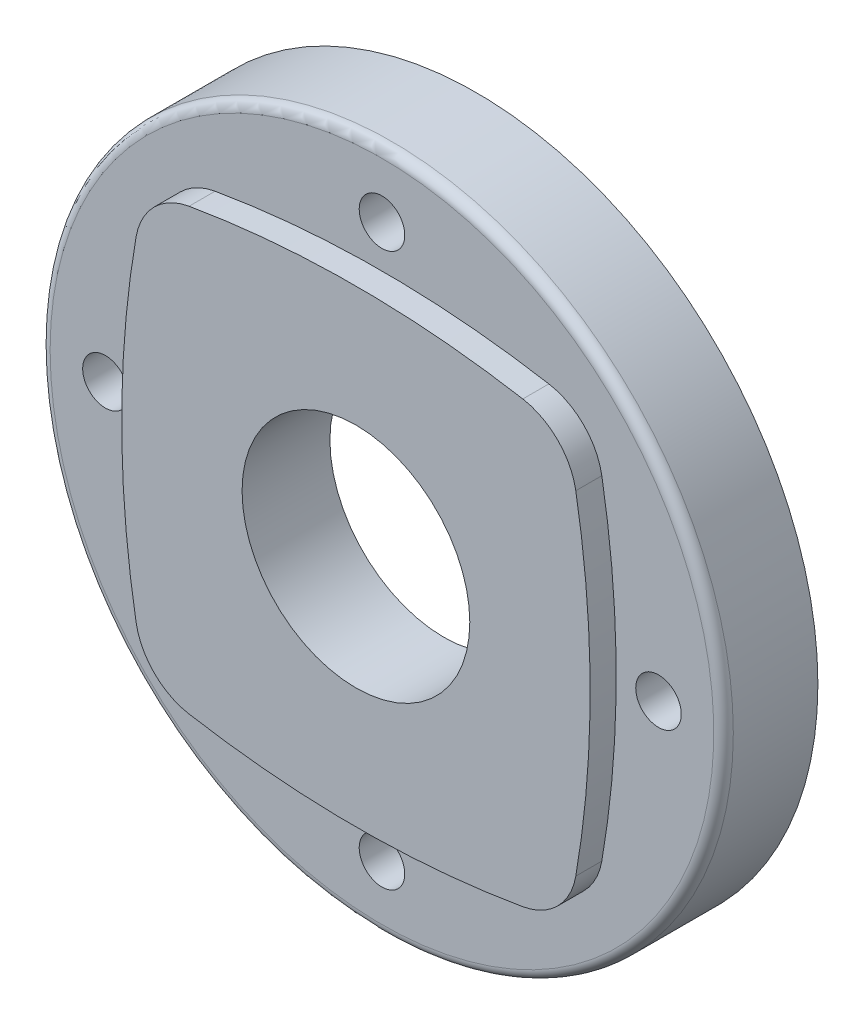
ISO-10303-21;
HEADER;
FILE_DESCRIPTION(('STEP AP214'),'2;1');
FILE_NAME('part.step','',(''),(''),'','','');
FILE_SCHEMA(('AUTOMOTIVE_DESIGN { 1 0 10303 214 1 1 1 1 }'));
ENDSEC;
DATA;
#1=APPLICATION_CONTEXT('core data for automotive mechanical design processes');
#2=APPLICATION_PROTOCOL_DEFINITION('international standard','automotive_design',2000,#1);
#3=PRODUCT_CONTEXT('',#1,'mechanical');
#4=PRODUCT('Part','Part','',(#3));
#5=PRODUCT_RELATED_PRODUCT_CATEGORY('part','',(#4));
#6=PRODUCT_DEFINITION_FORMATION('','',#4);
#7=PRODUCT_DEFINITION_CONTEXT('part definition',#1,'design');
#8=PRODUCT_DEFINITION('design','',#6,#7);
#9=PRODUCT_DEFINITION_SHAPE('','',#8);
#10=(LENGTH_UNIT() NAMED_UNIT(*) SI_UNIT(.MILLI.,.METRE.));
#11=(NAMED_UNIT(*) PLANE_ANGLE_UNIT() SI_UNIT($,.RADIAN.));
#12=(NAMED_UNIT(*) SI_UNIT($,.STERADIAN.) SOLID_ANGLE_UNIT());
#13=UNCERTAINTY_MEASURE_WITH_UNIT(LENGTH_MEASURE(1.E-05),#10,'distance_accuracy_value','');
#14=(GEOMETRIC_REPRESENTATION_CONTEXT(3) GLOBAL_UNCERTAINTY_ASSIGNED_CONTEXT((#13)) GLOBAL_UNIT_ASSIGNED_CONTEXT((#10,
#11,#12)) REPRESENTATION_CONTEXT('',''));
#15=CARTESIAN_POINT('',(0.,0.,0.));
#16=DIRECTION('',(0.,0.,1.));
#17=DIRECTION('',(1.,0.,0.));
#18=AXIS2_PLACEMENT_3D('',#15,#16,#17);
#19=CARTESIAN_POINT('',(-36.432,36.432,19.));
#20=DIRECTION('',(0.,0.,-1.));
#21=DIRECTION('',(-1.,0.,0.));
#22=AXIS2_PLACEMENT_3D('',#19,#20,#21);
#23=PLANE('',#22);
#24=CARTESIAN_POINT('',(114.,0.,19.));
#25=DIRECTION('',(0.,0.,1.));
#26=DIRECTION('',(1.,0.,0.));
#27=AXIS2_PLACEMENT_3D('',#24,#25,#26);
#28=CIRCLE('',#27,150.);
#29=CARTESIAN_POINT('',(-33.7909800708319,-25.6481229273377,19.));
#30=VERTEX_POINT('',#29);
#31=CARTESIAN_POINT('',(-33.7909800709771,25.64812292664,19.));
#32=VERTEX_POINT('',#31);
#33=EDGE_CURVE('E97',#30,#32,#28,.F.);
#34=ORIENTED_EDGE('',*,*,#33,.F.);
#35=CARTESIAN_POINT('',(-23.938248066,-23.938248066,19.));
#36=DIRECTION('',(0.,0.,1.));
#37=DIRECTION('',(1.,0.,0.));
#38=AXIS2_PLACEMENT_3D('',#35,#36,#37);
#39=CIRCLE('',#38,10.);
#40=CARTESIAN_POINT('',(-25.6481229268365,-33.7909800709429,19.));
#41=VERTEX_POINT('',#40);
#42=EDGE_CURVE('E91',#41,#30,#39,.F.);
#43=ORIENTED_EDGE('',*,*,#42,.F.);
#44=CARTESIAN_POINT('',(0.,114.,19.));
#45=DIRECTION('',(0.,0.,1.));
#46=DIRECTION('',(1.,0.,0.));
#47=AXIS2_PLACEMENT_3D('',#44,#45,#46);
#48=CIRCLE('',#47,150.);
#49=CARTESIAN_POINT('',(25.6481229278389,-33.7909800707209,19.));
#50=VERTEX_POINT('',#49);
#51=EDGE_CURVE('E80',#50,#41,#48,.F.);
#52=ORIENTED_EDGE('',*,*,#51,.F.);
#53=CARTESIAN_POINT('',(23.938248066,-23.938248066,19.));
#54=DIRECTION('',(0.,0.,1.));
#55=DIRECTION('',(1.,0.,0.));
#56=AXIS2_PLACEMENT_3D('',#53,#54,#55);
#57=CIRCLE('',#56,10.);
#58=CARTESIAN_POINT('',(33.7909800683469,-25.6481229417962,19.));
#59=VERTEX_POINT('',#58);
#60=EDGE_CURVE('E106',#59,#50,#57,.F.);
#61=ORIENTED_EDGE('',*,*,#60,.F.);
#62=CARTESIAN_POINT('',(-114.,0.,18.9999999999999));
#63=DIRECTION('',(0.,0.,1.));
#64=DIRECTION('',(1.,0.,0.));
#65=AXIS2_PLACEMENT_3D('',#62,#63,#64);
#66=CIRCLE('',#65,150.);
#67=CARTESIAN_POINT('',(33.7909800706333,25.6481229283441,19.));
#68=VERTEX_POINT('',#67);
#69=EDGE_CURVE('E203',#68,#59,#66,.F.);
#70=ORIENTED_EDGE('',*,*,#69,.F.);
#71=CARTESIAN_POINT('',(23.938248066,23.938248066,19.));
#72=DIRECTION('',(0.,0.,1.));
#73=DIRECTION('',(1.,0.,0.));
#74=AXIS2_PLACEMENT_3D('',#71,#72,#73);
#75=CIRCLE('',#74,10.);
#76=CARTESIAN_POINT('',(25.6481229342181,33.790980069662,19.));
#77=VERTEX_POINT('',#76);
#78=EDGE_CURVE('E200',#77,#68,#75,.F.);
#79=ORIENTED_EDGE('',*,*,#78,.F.);
#80=CARTESIAN_POINT('',(0.,-114.,19.));
#81=DIRECTION('',(0.,0.,1.));
#82=DIRECTION('',(1.,0.,0.));
#83=AXIS2_PLACEMENT_3D('',#80,#81,#82);
#84=CIRCLE('',#83,150.);
#85=CARTESIAN_POINT('',(-25.6481229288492,33.7909800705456,19.));
#86=VERTEX_POINT('',#85);
#87=EDGE_CURVE('E196',#86,#77,#84,.F.);
#88=ORIENTED_EDGE('',*,*,#87,.F.);
#89=CARTESIAN_POINT('',(-23.938248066,23.938248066,19.));
#90=DIRECTION('',(0.,0.,1.));
#91=DIRECTION('',(1.,0.,0.));
#92=AXIS2_PLACEMENT_3D('',#89,#90,#91);
#93=CIRCLE('',#92,10.);
#94=EDGE_CURVE('E191',#32,#86,#93,.F.);
#95=ORIENTED_EDGE('',*,*,#94,.F.);
#96=EDGE_LOOP('',(#34,#43,#52,#61,#70,#79,#88,#95));
#97=FACE_BOUND('',#96,.T.);
#98=CARTESIAN_POINT('',(0.,0.,19.));
#99=DIRECTION('',(0.,0.,-1.));
#100=DIRECTION('',(-1.,0.,0.));
#101=AXIS2_PLACEMENT_3D('',#98,#99,#100);
#102=CIRCLE('',#101,17.5);
#103=CARTESIAN_POINT('',(-17.5,0.,19.));
#104=VERTEX_POINT('',#103);
#105=EDGE_CURVE('E20',#104,#104,#102,.T.);
#106=ORIENTED_EDGE('',*,*,#105,.T.);
#107=EDGE_LOOP('',(#106));
#108=FACE_BOUND('',#107,.T.);
#109=ADVANCED_FACE('F16',(#97,#108),#23,.F.);
#110=CARTESIAN_POINT('',(0.,0.,19.));
#111=DIRECTION('',(0.,0.,-1.));
#112=DIRECTION('',(-1.,0.,0.));
#113=AXIS2_PLACEMENT_3D('',#110,#111,#112);
#114=CYLINDRICAL_SURFACE('',#113,17.5);
#115=ORIENTED_EDGE('',*,*,#105,.F.);
#116=EDGE_LOOP('',(#115));
#117=FACE_BOUND('',#116,.T.);
#118=CARTESIAN_POINT('',(0.,0.,5.49999999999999));
#119=DIRECTION('',(0.,0.,-1.));
#120=DIRECTION('',(-1.,0.,0.));
#121=AXIS2_PLACEMENT_3D('',#118,#119,#120);
#122=CIRCLE('',#121,17.5);
#123=CARTESIAN_POINT('',(-17.5,0.,5.49999999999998));
#124=VERTEX_POINT('',#123);
#125=EDGE_CURVE('E185',#124,#124,#122,.T.);
#126=ORIENTED_EDGE('',*,*,#125,.T.);
#127=EDGE_LOOP('',(#126));
#128=FACE_BOUND('',#127,.T.);
#129=ADVANCED_FACE('F295',(#117,#128),#114,.F.);
#130=CARTESIAN_POINT('',(-23.938248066,-23.938248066,15.));
#131=DIRECTION('',(0.,0.,1.));
#132=DIRECTION('',(1.,0.,0.));
#133=AXIS2_PLACEMENT_3D('',#130,#131,#132);
#134=CYLINDRICAL_SURFACE('',#133,10.);
#135=ORIENTED_EDGE('',*,*,#42,.T.);
#136=DIRECTION('',(0.,0.,1.));
#137=VECTOR('',#136,1.);
#138=CARTESIAN_POINT('',(-33.7909800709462,-25.6481229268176,15.));
#139=LINE('',#138,#137);
#140=CARTESIAN_POINT('',(-33.7909800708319,-25.6481229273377,15.));
#141=VERTEX_POINT('',#140);
#142=EDGE_CURVE('E190',#141,#30,#139,.T.);
#143=ORIENTED_EDGE('',*,*,#142,.F.);
#144=CARTESIAN_POINT('',(-23.938248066,-23.938248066,15.));
#145=DIRECTION('',(0.,0.,1.));
#146=DIRECTION('',(1.,0.,0.));
#147=AXIS2_PLACEMENT_3D('',#144,#145,#146);
#148=CIRCLE('',#147,10.);
#149=CARTESIAN_POINT('',(-25.6481229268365,-33.7909800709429,15.));
#150=VERTEX_POINT('',#149);
#151=EDGE_CURVE('E104',#141,#150,#148,.T.);
#152=ORIENTED_EDGE('',*,*,#151,.T.);
#153=DIRECTION('',(0.,0.,1.));
#154=VECTOR('',#153,1.);
#155=CARTESIAN_POINT('',(-25.6481229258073,-33.7909800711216,15.));
#156=LINE('',#155,#154);
#157=EDGE_CURVE('E85',#41,#150,#156,.F.);
#158=ORIENTED_EDGE('',*,*,#157,.F.);
#159=EDGE_LOOP('',(#135,#143,#152,#158));
#160=FACE_BOUND('',#159,.T.);
#161=ADVANCED_FACE('F103',(#160),#134,.T.);
#162=CARTESIAN_POINT('',(0.,114.,15.));
#163=DIRECTION('',(0.,0.,1.));
#164=DIRECTION('',(1.,0.,0.));
#165=AXIS2_PLACEMENT_3D('',#162,#163,#164);
#166=CYLINDRICAL_SURFACE('',#165,150.);
#167=CARTESIAN_POINT('',(0.,114.,15.));
#168=DIRECTION('',(0.,0.,1.));
#169=DIRECTION('',(1.,0.,0.));
#170=AXIS2_PLACEMENT_3D('',#167,#168,#169);
#171=CIRCLE('',#170,150.);
#172=CARTESIAN_POINT('',(25.6481229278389,-33.7909800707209,15.));
#173=VERTEX_POINT('',#172);
#174=EDGE_CURVE('E180',#150,#173,#171,.T.);
#175=ORIENTED_EDGE('',*,*,#174,.T.);
#176=DIRECTION('',(0.,0.,1.));
#177=VECTOR('',#176,1.);
#178=CARTESIAN_POINT('',(25.64812292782,-33.7909800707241,15.));
#179=LINE('',#178,#177);
#180=EDGE_CURVE('E87',#50,#173,#179,.F.);
#181=ORIENTED_EDGE('',*,*,#180,.F.);
#182=ORIENTED_EDGE('',*,*,#51,.T.);
#183=ORIENTED_EDGE('',*,*,#157,.T.);
#184=EDGE_LOOP('',(#175,#181,#182,#183));
#185=FACE_BOUND('',#184,.T.);
#186=ADVANCED_FACE('F83',(#185),#166,.T.);
#187=CARTESIAN_POINT('',(23.938248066,-23.938248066,15.));
#188=DIRECTION('',(0.,0.,1.));
#189=DIRECTION('',(1.,0.,0.));
#190=AXIS2_PLACEMENT_3D('',#187,#188,#189);
#191=CYLINDRICAL_SURFACE('',#190,10.);
#192=ORIENTED_EDGE('',*,*,#60,.T.);
#193=ORIENTED_EDGE('',*,*,#180,.T.);
#194=CARTESIAN_POINT('',(23.938248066,-23.938248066,15.));
#195=DIRECTION('',(0.,0.,1.));
#196=DIRECTION('',(1.,0.,0.));
#197=AXIS2_PLACEMENT_3D('',#194,#195,#196);
#198=CIRCLE('',#197,10.);
#199=CARTESIAN_POINT('',(33.7909800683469,-25.6481229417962,15.));
#200=VERTEX_POINT('',#199);
#201=EDGE_CURVE('E176',#173,#200,#198,.T.);
#202=ORIENTED_EDGE('',*,*,#201,.T.);
#203=DIRECTION('',(0.,0.,1.));
#204=VECTOR('',#203,1.);
#205=CARTESIAN_POINT('',(33.7909800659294,-25.6481229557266,15.));
#206=LINE('',#205,#204);
#207=EDGE_CURVE('E202',#59,#200,#206,.F.);
#208=ORIENTED_EDGE('',*,*,#207,.F.);
#209=EDGE_LOOP('',(#192,#193,#202,#208));
#210=FACE_BOUND('',#209,.T.);
#211=ADVANCED_FACE('F212',(#210),#191,.T.);
#212=CARTESIAN_POINT('',(-114.,0.,14.9999999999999));
#213=DIRECTION('',(0.,0.,1.));
#214=DIRECTION('',(1.,0.,0.));
#215=AXIS2_PLACEMENT_3D('',#212,#213,#214);
#216=CYLINDRICAL_SURFACE('',#215,150.);
#217=CARTESIAN_POINT('',(-114.,0.,14.9999999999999));
#218=DIRECTION('',(0.,0.,1.));
#219=DIRECTION('',(1.,0.,0.));
#220=AXIS2_PLACEMENT_3D('',#217,#218,#219);
#221=CIRCLE('',#220,150.);
#222=CARTESIAN_POINT('',(33.7909800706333,25.6481229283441,15.));
#223=VERTEX_POINT('',#222);
#224=EDGE_CURVE('E172',#200,#223,#221,.T.);
#225=ORIENTED_EDGE('',*,*,#224,.T.);
#226=DIRECTION('',(0.,0.,1.));
#227=VECTOR('',#226,1.);
#228=CARTESIAN_POINT('',(33.7909800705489,25.6481229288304,15.));
#229=LINE('',#228,#227);
#230=EDGE_CURVE('E199',#68,#223,#229,.F.);
#231=ORIENTED_EDGE('',*,*,#230,.F.);
#232=ORIENTED_EDGE('',*,*,#69,.T.);
#233=ORIENTED_EDGE('',*,*,#207,.T.);
#234=EDGE_LOOP('',(#225,#231,#232,#233));
#235=FACE_BOUND('',#234,.T.);
#236=ADVANCED_FACE('F220',(#235),#216,.T.);
#237=CARTESIAN_POINT('',(23.938248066,23.938248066,15.));
#238=DIRECTION('',(0.,0.,1.));
#239=DIRECTION('',(1.,0.,0.));
#240=AXIS2_PLACEMENT_3D('',#237,#238,#239);
#241=CYLINDRICAL_SURFACE('',#240,10.);
#242=ORIENTED_EDGE('',*,*,#78,.T.);
#243=ORIENTED_EDGE('',*,*,#230,.T.);
#244=CARTESIAN_POINT('',(23.938248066,23.938248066,15.));
#245=DIRECTION('',(0.,0.,1.));
#246=DIRECTION('',(1.,0.,0.));
#247=AXIS2_PLACEMENT_3D('',#244,#245,#246);
#248=CIRCLE('',#247,10.);
#249=CARTESIAN_POINT('',(25.6481229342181,33.790980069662,15.));
#250=VERTEX_POINT('',#249);
#251=EDGE_CURVE('E168',#223,#250,#248,.T.);
#252=ORIENTED_EDGE('',*,*,#251,.T.);
#253=DIRECTION('',(0.,0.,1.));
#254=VECTOR('',#253,1.);
#255=CARTESIAN_POINT('',(25.6481229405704,33.7909800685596,15.));
#256=LINE('',#255,#254);
#257=EDGE_CURVE('E195',#77,#250,#256,.F.);
#258=ORIENTED_EDGE('',*,*,#257,.F.);
#259=EDGE_LOOP('',(#242,#243,#252,#258));
#260=FACE_BOUND('',#259,.T.);
#261=ADVANCED_FACE('F313',(#260),#241,.T.);
#262=CARTESIAN_POINT('',(0.,-114.,15.));
#263=DIRECTION('',(0.,0.,1.));
#264=DIRECTION('',(1.,0.,0.));
#265=AXIS2_PLACEMENT_3D('',#262,#263,#264);
#266=CYLINDRICAL_SURFACE('',#265,150.);
#267=CARTESIAN_POINT('',(0.,-114.,15.));
#268=DIRECTION('',(0.,0.,1.));
#269=DIRECTION('',(1.,0.,0.));
#270=AXIS2_PLACEMENT_3D('',#267,#268,#269);
#271=CIRCLE('',#270,150.);
#272=CARTESIAN_POINT('',(-25.6481229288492,33.7909800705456,15.));
#273=VERTEX_POINT('',#272);
#274=EDGE_CURVE('E164',#250,#273,#271,.T.);
#275=ORIENTED_EDGE('',*,*,#274,.T.);
#276=DIRECTION('',(0.,0.,1.));
#277=VECTOR('',#276,1.);
#278=CARTESIAN_POINT('',(-25.6481229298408,33.7909800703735,15.));
#279=LINE('',#278,#277);
#280=EDGE_CURVE('E194',#86,#273,#279,.F.);
#281=ORIENTED_EDGE('',*,*,#280,.F.);
#282=ORIENTED_EDGE('',*,*,#87,.T.);
#283=ORIENTED_EDGE('',*,*,#257,.T.);
#284=EDGE_LOOP('',(#275,#281,#282,#283));
#285=FACE_BOUND('',#284,.T.);
#286=ADVANCED_FACE('F316',(#285),#266,.T.);
#287=CARTESIAN_POINT('',(-23.938248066,23.938248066,15.));
#288=DIRECTION('',(0.,0.,1.));
#289=DIRECTION('',(1.,0.,0.));
#290=AXIS2_PLACEMENT_3D('',#287,#288,#289);
#291=CYLINDRICAL_SURFACE('',#290,10.);
#292=ORIENTED_EDGE('',*,*,#94,.T.);
#293=ORIENTED_EDGE('',*,*,#280,.T.);
#294=CARTESIAN_POINT('',(-23.938248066,23.938248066,15.));
#295=DIRECTION('',(0.,0.,1.));
#296=DIRECTION('',(1.,0.,0.));
#297=AXIS2_PLACEMENT_3D('',#294,#295,#296);
#298=CIRCLE('',#297,10.);
#299=CARTESIAN_POINT('',(-33.7909800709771,25.64812292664,15.));
#300=VERTEX_POINT('',#299);
#301=EDGE_CURVE('E160',#273,#300,#298,.T.);
#302=ORIENTED_EDGE('',*,*,#301,.T.);
#303=DIRECTION('',(0.,0.,1.));
#304=VECTOR('',#303,1.);
#305=CARTESIAN_POINT('',(-33.7909800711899,25.6481229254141,15.));
#306=LINE('',#305,#304);
#307=EDGE_CURVE('E36',#32,#300,#306,.F.);
#308=ORIENTED_EDGE('',*,*,#307,.F.);
#309=EDGE_LOOP('',(#292,#293,#302,#308));
#310=FACE_BOUND('',#309,.T.);
#311=ADVANCED_FACE('F319',(#310),#291,.T.);
#312=CARTESIAN_POINT('',(114.,0.,15.));
#313=DIRECTION('',(0.,0.,1.));
#314=DIRECTION('',(1.,0.,0.));
#315=AXIS2_PLACEMENT_3D('',#312,#313,#314);
#316=CYLINDRICAL_SURFACE('',#315,150.);
#317=ORIENTED_EDGE('',*,*,#33,.T.);
#318=ORIENTED_EDGE('',*,*,#307,.T.);
#319=CARTESIAN_POINT('',(114.,0.,15.));
#320=DIRECTION('',(0.,0.,1.));
#321=DIRECTION('',(1.,0.,0.));
#322=AXIS2_PLACEMENT_3D('',#319,#320,#321);
#323=CIRCLE('',#322,150.);
#324=EDGE_CURVE('E157',#300,#141,#323,.T.);
#325=ORIENTED_EDGE('',*,*,#324,.T.);
#326=ORIENTED_EDGE('',*,*,#142,.T.);
#327=EDGE_LOOP('',(#317,#318,#325,#326));
#328=FACE_BOUND('',#327,.T.);
#329=ADVANCED_FACE('F292',(#328),#316,.T.);
#330=CARTESIAN_POINT('',(35.42,35.42,5.5));
#331=DIRECTION('',(0.,0.,1.));
#332=DIRECTION('',(0.,-1.,0.));
#333=AXIS2_PLACEMENT_3D('',#330,#331,#332);
#334=PLANE('',#333);
#335=CARTESIAN_POINT('',(0.,0.,5.49999999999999));
#336=DIRECTION('',(0.,0.,-1.));
#337=DIRECTION('',(-1.,0.,0.));
#338=AXIS2_PLACEMENT_3D('',#335,#336,#337);
#339=CIRCLE('',#338,35.);
#340=CARTESIAN_POINT('',(-35.,0.,5.49999999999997));
#341=VERTEX_POINT('',#340);
#342=EDGE_CURVE('E152',#341,#341,#339,.T.);
#343=ORIENTED_EDGE('',*,*,#342,.T.);
#344=EDGE_LOOP('',(#343));
#345=FACE_BOUND('',#344,.T.);
#346=ORIENTED_EDGE('',*,*,#125,.F.);
#347=EDGE_LOOP('',(#346));
#348=FACE_BOUND('',#347,.T.);
#349=ADVANCED_FACE('F289',(#345,#348),#334,.F.);
#350=CARTESIAN_POINT('',(-51.612,51.612,15.));
#351=DIRECTION('',(0.,0.,-1.));
#352=DIRECTION('',(-1.,0.,0.));
#353=AXIS2_PLACEMENT_3D('',#350,#351,#352);
#354=PLANE('',#353);
#355=CARTESIAN_POINT('',(0.,0.,15.));
#356=DIRECTION('',(0.,0.,-1.));
#357=DIRECTION('',(-1.,0.,0.));
#358=AXIS2_PLACEMENT_3D('',#355,#356,#357);
#359=CIRCLE('',#358,50.999999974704);
#360=CARTESIAN_POINT('',(-50.999999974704,0.,15.));
#361=VERTEX_POINT('',#360);
#362=EDGE_CURVE('E156',#361,#361,#359,.T.);
#363=ORIENTED_EDGE('',*,*,#362,.F.);
#364=EDGE_LOOP('',(#363));
#365=FACE_BOUND('',#364,.T.);
#366=CARTESIAN_POINT('',(0.,42.5,15.));
#367=DIRECTION('',(0.,0.,-1.));
#368=DIRECTION('',(-1.,0.,0.));
#369=AXIS2_PLACEMENT_3D('',#366,#367,#368);
#370=CIRCLE('',#369,3.5);
#371=CARTESIAN_POINT('',(-3.49999999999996,42.5,15.));
#372=VERTEX_POINT('',#371);
#373=EDGE_CURVE('E136',#372,#372,#370,.T.);
#374=ORIENTED_EDGE('',*,*,#373,.T.);
#375=EDGE_LOOP('',(#374));
#376=FACE_BOUND('',#375,.T.);
#377=CARTESIAN_POINT('',(-42.5,0.,15.));
#378=DIRECTION('',(0.,0.,-1.));
#379=DIRECTION('',(-1.,0.,0.));
#380=AXIS2_PLACEMENT_3D('',#377,#378,#379);
#381=CIRCLE('',#380,3.5);
#382=CARTESIAN_POINT('',(-46.,0.,15.));
#383=VERTEX_POINT('',#382);
#384=EDGE_CURVE('E140',#383,#383,#381,.T.);
#385=ORIENTED_EDGE('',*,*,#384,.T.);
#386=EDGE_LOOP('',(#385));
#387=FACE_BOUND('',#386,.T.);
#388=CARTESIAN_POINT('',(42.5,0.,15.));
#389=DIRECTION('',(0.,0.,-1.));
#390=DIRECTION('',(-1.,0.,0.));
#391=AXIS2_PLACEMENT_3D('',#388,#389,#390);
#392=CIRCLE('',#391,3.5);
#393=CARTESIAN_POINT('',(39.,0.,15.));
#394=VERTEX_POINT('',#393);
#395=EDGE_CURVE('E144',#394,#394,#392,.T.);
#396=ORIENTED_EDGE('',*,*,#395,.T.);
#397=EDGE_LOOP('',(#396));
#398=FACE_BOUND('',#397,.T.);
#399=CARTESIAN_POINT('',(0.,-42.5,15.));
#400=DIRECTION('',(0.,0.,-1.));
#401=DIRECTION('',(-1.,0.,0.));
#402=AXIS2_PLACEMENT_3D('',#399,#400,#401);
#403=CIRCLE('',#402,3.5);
#404=CARTESIAN_POINT('',(-3.49999999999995,-42.5,15.));
#405=VERTEX_POINT('',#404);
#406=EDGE_CURVE('E148',#405,#405,#403,.T.);
#407=ORIENTED_EDGE('',*,*,#406,.T.);
#408=EDGE_LOOP('',(#407));
#409=FACE_BOUND('',#408,.T.);
#410=ORIENTED_EDGE('',*,*,#301,.F.);
#411=ORIENTED_EDGE('',*,*,#274,.F.);
#412=ORIENTED_EDGE('',*,*,#251,.F.);
#413=ORIENTED_EDGE('',*,*,#224,.F.);
#414=ORIENTED_EDGE('',*,*,#201,.F.);
#415=ORIENTED_EDGE('',*,*,#174,.F.);
#416=ORIENTED_EDGE('',*,*,#151,.F.);
#417=ORIENTED_EDGE('',*,*,#324,.F.);
#418=EDGE_LOOP('',(#410,#411,#412,#413,#414,#415,#416,#417));
#419=FACE_BOUND('',#418,.T.);
#420=ADVANCED_FACE('F217',(#365,#376,#387,#398,#409,#419),#354,.F.);
#421=CARTESIAN_POINT('',(0.,0.,13.5));
#422=DIRECTION('',(0.,0.,-1.));
#423=DIRECTION('',(1.,0.,0.));
#424=AXIS2_PLACEMENT_3D('',#421,#422,#423);
#425=TOROIDAL_SURFACE('',#424,51.,1.5);
#426=ORIENTED_EDGE('',*,*,#362,.T.);
#427=EDGE_LOOP('',(#426));
#428=FACE_BOUND('',#427,.T.);
#429=CARTESIAN_POINT('',(0.,0.,13.5));
#430=DIRECTION('',(0.,0.,-1.));
#431=DIRECTION('',(-1.,0.,0.));
#432=AXIS2_PLACEMENT_3D('',#429,#430,#431);
#433=CIRCLE('',#432,52.5);
#434=CARTESIAN_POINT('',(-52.5,0.,13.5));
#435=VERTEX_POINT('',#434);
#436=EDGE_CURVE('E135',#435,#435,#433,.T.);
#437=ORIENTED_EDGE('',*,*,#436,.F.);
#438=EDGE_LOOP('',(#437));
#439=FACE_BOUND('',#438,.T.);
#440=ADVANCED_FACE('F239',(#428,#439),#425,.T.);
#441=CARTESIAN_POINT('',(0.,0.,5.49999999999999));
#442=DIRECTION('',(0.,0.,-1.));
#443=DIRECTION('',(-1.,0.,0.));
#444=AXIS2_PLACEMENT_3D('',#441,#442,#443);
#445=CYLINDRICAL_SURFACE('',#444,35.);
#446=CARTESIAN_POINT('',(0.,0.,0.499999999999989));
#447=DIRECTION('',(0.,0.,-1.));
#448=DIRECTION('',(-1.,0.,0.));
#449=AXIS2_PLACEMENT_3D('',#446,#447,#448);
#450=CIRCLE('',#449,35.);
#451=CARTESIAN_POINT('',(-35.,0.,0.499999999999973));
#452=VERTEX_POINT('',#451);
#453=EDGE_CURVE('E131',#452,#452,#450,.T.);
#454=ORIENTED_EDGE('',*,*,#453,.T.);
#455=EDGE_LOOP('',(#454));
#456=FACE_BOUND('',#455,.T.);
#457=ORIENTED_EDGE('',*,*,#342,.F.);
#458=EDGE_LOOP('',(#457));
#459=FACE_BOUND('',#458,.T.);
#460=ADVANCED_FACE('F250',(#456,#459),#445,.F.);
#461=CARTESIAN_POINT('',(0.,-42.5,15.));
#462=DIRECTION('',(0.,0.,-1.));
#463=DIRECTION('',(-1.,0.,0.));
#464=AXIS2_PLACEMENT_3D('',#461,#462,#463);
#465=CYLINDRICAL_SURFACE('',#464,3.5);
#466=ORIENTED_EDGE('',*,*,#406,.F.);
#467=EDGE_LOOP('',(#466));
#468=FACE_BOUND('',#467,.T.);
#469=CARTESIAN_POINT('',(0.,-42.5,0.499999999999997));
#470=DIRECTION('',(0.,0.,-1.));
#471=DIRECTION('',(-1.,0.,0.));
#472=AXIS2_PLACEMENT_3D('',#469,#470,#471);
#473=CIRCLE('',#472,3.5);
#474=CARTESIAN_POINT('',(-3.49999999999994,-42.5,0.499999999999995));
#475=VERTEX_POINT('',#474);
#476=EDGE_CURVE('E127',#475,#475,#473,.T.);
#477=ORIENTED_EDGE('',*,*,#476,.T.);
#478=EDGE_LOOP('',(#477));
#479=FACE_BOUND('',#478,.T.);
#480=ADVANCED_FACE('F286',(#468,#479),#465,.F.);
#481=CARTESIAN_POINT('',(42.5,0.,15.));
#482=DIRECTION('',(0.,0.,-1.));
#483=DIRECTION('',(-1.,0.,0.));
#484=AXIS2_PLACEMENT_3D('',#481,#482,#483);
#485=CYLINDRICAL_SURFACE('',#484,3.5);
#486=ORIENTED_EDGE('',*,*,#395,.F.);
#487=EDGE_LOOP('',(#486));
#488=FACE_BOUND('',#487,.T.);
#489=CARTESIAN_POINT('',(42.5,0.,0.500000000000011));
#490=DIRECTION('',(0.,0.,-1.));
#491=DIRECTION('',(-1.,0.,0.));
#492=AXIS2_PLACEMENT_3D('',#489,#490,#491);
#493=CIRCLE('',#492,3.5);
#494=CARTESIAN_POINT('',(39.,0.,0.500000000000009));
#495=VERTEX_POINT('',#494);
#496=EDGE_CURVE('E123',#495,#495,#493,.T.);
#497=ORIENTED_EDGE('',*,*,#496,.T.);
#498=EDGE_LOOP('',(#497));
#499=FACE_BOUND('',#498,.T.);
#500=ADVANCED_FACE('F353',(#488,#499),#485,.F.);
#501=CARTESIAN_POINT('',(-42.5,0.,15.));
#502=DIRECTION('',(0.,0.,-1.));
#503=DIRECTION('',(-1.,0.,0.));
#504=AXIS2_PLACEMENT_3D('',#501,#502,#503);
#505=CYLINDRICAL_SURFACE('',#504,3.5);
#506=ORIENTED_EDGE('',*,*,#384,.F.);
#507=EDGE_LOOP('',(#506));
#508=FACE_BOUND('',#507,.T.);
#509=CARTESIAN_POINT('',(-42.5,0.,0.499999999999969));
#510=DIRECTION('',(0.,0.,-1.));
#511=DIRECTION('',(-1.,0.,0.));
#512=AXIS2_PLACEMENT_3D('',#509,#510,#511);
#513=CIRCLE('',#512,3.5);
#514=CARTESIAN_POINT('',(-46.,0.,0.499999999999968));
#515=VERTEX_POINT('',#514);
#516=EDGE_CURVE('E119',#515,#515,#513,.T.);
#517=ORIENTED_EDGE('',*,*,#516,.T.);
#518=EDGE_LOOP('',(#517));
#519=FACE_BOUND('',#518,.T.);
#520=ADVANCED_FACE('F359',(#508,#519),#505,.F.);
#521=CARTESIAN_POINT('',(0.,42.5,15.));
#522=DIRECTION('',(0.,0.,-1.));
#523=DIRECTION('',(-1.,0.,0.));
#524=AXIS2_PLACEMENT_3D('',#521,#522,#523);
#525=CYLINDRICAL_SURFACE('',#524,3.5);
#526=ORIENTED_EDGE('',*,*,#373,.F.);
#527=EDGE_LOOP('',(#526));
#528=FACE_BOUND('',#527,.T.);
#529=CARTESIAN_POINT('',(0.,42.5,0.499999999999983));
#530=DIRECTION('',(0.,0.,-1.));
#531=DIRECTION('',(-1.,0.,0.));
#532=AXIS2_PLACEMENT_3D('',#529,#530,#531);
#533=CIRCLE('',#532,3.5);
#534=CARTESIAN_POINT('',(-3.49999999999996,42.5,0.499999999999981));
#535=VERTEX_POINT('',#534);
#536=EDGE_CURVE('E27',#535,#535,#533,.T.);
#537=ORIENTED_EDGE('',*,*,#536,.T.);
#538=EDGE_LOOP('',(#537));
#539=FACE_BOUND('',#538,.T.);
#540=ADVANCED_FACE('F269',(#528,#539),#525,.F.);
#541=CARTESIAN_POINT('',(0.,0.,13.5));
#542=DIRECTION('',(0.,0.,-1.));
#543=DIRECTION('',(-1.,0.,0.));
#544=AXIS2_PLACEMENT_3D('',#541,#542,#543);
#545=CYLINDRICAL_SURFACE('',#544,52.5);
#546=ORIENTED_EDGE('',*,*,#436,.T.);
#547=EDGE_LOOP('',(#546));
#548=FACE_BOUND('',#547,.T.);
#549=CARTESIAN_POINT('',(0.,0.,0.49999999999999));
#550=DIRECTION('',(0.,0.,-1.));
#551=DIRECTION('',(-1.,0.,0.));
#552=AXIS2_PLACEMENT_3D('',#549,#550,#551);
#553=CIRCLE('',#552,52.5);
#554=CARTESIAN_POINT('',(-52.5,0.,0.499999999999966));
#555=VERTEX_POINT('',#554);
#556=EDGE_CURVE('E11',#555,#555,#553,.F.);
#557=ORIENTED_EDGE('',*,*,#556,.T.);
#558=EDGE_LOOP('',(#557));
#559=FACE_BOUND('',#558,.T.);
#560=ADVANCED_FACE('F265',(#548,#559),#545,.T.);
#561=CARTESIAN_POINT('',(53.13,53.13,0.500000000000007));
#562=DIRECTION('',(0.,0.,1.));
#563=DIRECTION('',(0.,-1.,0.));
#564=AXIS2_PLACEMENT_3D('',#561,#562,#563);
#565=PLANE('',#564);
#566=ORIENTED_EDGE('',*,*,#556,.F.);
#567=EDGE_LOOP('',(#566));
#568=FACE_BOUND('',#567,.T.);
#569=ORIENTED_EDGE('',*,*,#536,.F.);
#570=EDGE_LOOP('',(#569));
#571=FACE_BOUND('',#570,.T.);
#572=ORIENTED_EDGE('',*,*,#516,.F.);
#573=EDGE_LOOP('',(#572));
#574=FACE_BOUND('',#573,.T.);
#575=ORIENTED_EDGE('',*,*,#496,.F.);
#576=EDGE_LOOP('',(#575));
#577=FACE_BOUND('',#576,.T.);
#578=ORIENTED_EDGE('',*,*,#476,.F.);
#579=EDGE_LOOP('',(#578));
#580=FACE_BOUND('',#579,.T.);
#581=ORIENTED_EDGE('',*,*,#453,.F.);
#582=EDGE_LOOP('',(#581));
#583=FACE_BOUND('',#582,.T.);
#584=ADVANCED_FACE('F18',(#568,#571,#574,#577,#580,#583),#565,.F.);
#585=CLOSED_SHELL('',(#109,#129,#161,#186,#211,#236,#261,#286,#311,#329,#349,#420,#440,#460,
#480,#500,#520,#540,#560,#584));
#586=MANIFOLD_SOLID_BREP('B1',#585);
#587=ADVANCED_BREP_SHAPE_REPRESENTATION('',(#18,#586),#14);
#588=SHAPE_DEFINITION_REPRESENTATION(#9,#587);
ENDSEC;
END-ISO-10303-21;
